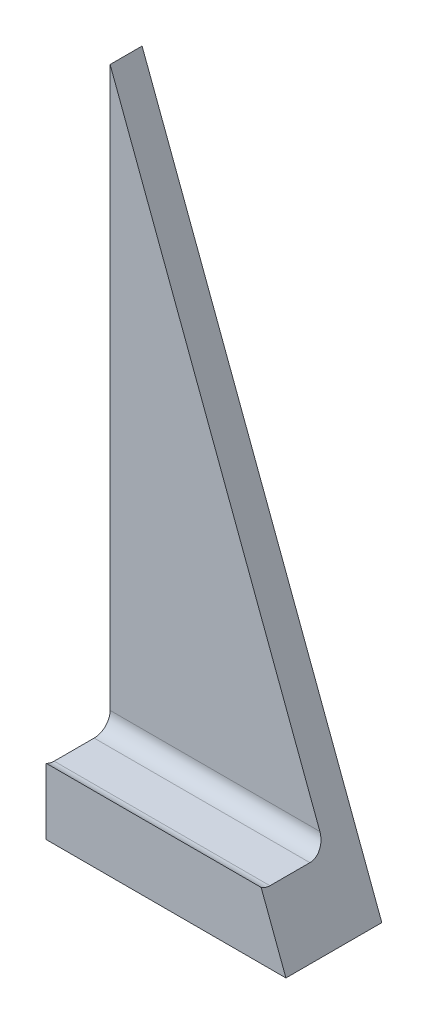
ISO-10303-21;
HEADER;
FILE_DESCRIPTION(('STEP AP214'),'2;1');
FILE_NAME('part.step','',(''),(''),'','','');
FILE_SCHEMA(('AUTOMOTIVE_DESIGN { 1 0 10303 214 1 1 1 1 }'));
ENDSEC;
DATA;
#1=APPLICATION_CONTEXT('core data for automotive mechanical design processes');
#2=APPLICATION_PROTOCOL_DEFINITION('international standard','automotive_design',2000,#1);
#3=PRODUCT_CONTEXT('',#1,'mechanical');
#4=PRODUCT('Part','Part','',(#3));
#5=PRODUCT_RELATED_PRODUCT_CATEGORY('part','',(#4));
#6=PRODUCT_DEFINITION_FORMATION('','',#4);
#7=PRODUCT_DEFINITION_CONTEXT('part definition',#1,'design');
#8=PRODUCT_DEFINITION('design','',#6,#7);
#9=PRODUCT_DEFINITION_SHAPE('','',#8);
#10=(LENGTH_UNIT() NAMED_UNIT(*) SI_UNIT(.MILLI.,.METRE.));
#11=(NAMED_UNIT(*) PLANE_ANGLE_UNIT() SI_UNIT($,.RADIAN.));
#12=(NAMED_UNIT(*) SI_UNIT($,.STERADIAN.) SOLID_ANGLE_UNIT());
#13=UNCERTAINTY_MEASURE_WITH_UNIT(LENGTH_MEASURE(1.E-05),#10,'distance_accuracy_value','');
#14=(GEOMETRIC_REPRESENTATION_CONTEXT(3) GLOBAL_UNCERTAINTY_ASSIGNED_CONTEXT((#13)) GLOBAL_UNIT_ASSIGNED_CONTEXT((#10,
#11,#12)) REPRESENTATION_CONTEXT('',''));
#15=CARTESIAN_POINT('',(0.,0.,0.));
#16=DIRECTION('',(0.,0.,1.));
#17=DIRECTION('',(1.,0.,0.));
#18=AXIS2_PLACEMENT_3D('',#15,#16,#17);
#19=CARTESIAN_POINT('',(-25.,60.,4.));
#20=DIRECTION('',(0.,0.,1.));
#21=DIRECTION('',(1.,0.,0.));
#22=AXIS2_PLACEMENT_3D('',#19,#20,#21);
#23=PLANE('',#22);
#24=DIRECTION('',(0.,-1.,0.));
#25=VECTOR('',#24,1.);
#26=CARTESIAN_POINT('',(0.,70.,4.));
#27=LINE('',#26,#25);
#28=CARTESIAN_POINT('',(0.,80.,4.));
#29=VERTEX_POINT('',#28);
#30=CARTESIAN_POINT('',(0.,10.,4.));
#31=VERTEX_POINT('',#30);
#32=EDGE_CURVE('E96',#29,#31,#27,.T.);
#33=ORIENTED_EDGE('',*,*,#32,.T.);
#34=DIRECTION('',(1.,0.,0.));
#35=VECTOR('',#34,1.);
#36=CARTESIAN_POINT('',(-875.,10.,4.));
#37=LINE('',#36,#35);
#38=CARTESIAN_POINT('',(26.25,10.,4.));
#39=VERTEX_POINT('',#38);
#40=EDGE_CURVE('E10',#31,#39,#37,.T.);
#41=ORIENTED_EDGE('',*,*,#40,.T.);
#42=DIRECTION('',(-0.351123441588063,0.936329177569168,0.));
#43=VECTOR('',#42,1.);
#44=CARTESIAN_POINT('',(16.746575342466,35.342465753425,4.));
#45=LINE('',#44,#43);
#46=EDGE_CURVE('E93',#39,#29,#45,.T.);
#47=ORIENTED_EDGE('',*,*,#46,.T.);
#48=EDGE_LOOP('',(#33,#41,#47));
#49=FACE_BOUND('',#48,.T.);
#50=ADVANCED_FACE('F16',(#49),#23,.T.);
#51=CARTESIAN_POINT('',(-875.,10.,6.));
#52=DIRECTION('',(1.,0.,0.));
#53=DIRECTION('',(0.,0.,1.));
#54=AXIS2_PLACEMENT_3D('',#51,#52,#53);
#55=CYLINDRICAL_SURFACE('',#54,2.);
#56=CARTESIAN_POINT('',(26.25,10.,6.));
#57=DIRECTION('',(-0.936329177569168,-0.351123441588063,0.));
#58=DIRECTION('',(0.351123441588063,-0.936329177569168,0.));
#59=AXIS2_PLACEMENT_3D('',#56,#57,#58);
#60=ELLIPSE('',#59,2.136000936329,2.);
#61=CARTESIAN_POINT('',(27.,8.,6.));
#62=VERTEX_POINT('',#61);
#63=EDGE_CURVE('E102',#39,#62,#60,.T.);
#64=ORIENTED_EDGE('',*,*,#63,.F.);
#65=ORIENTED_EDGE('',*,*,#40,.F.);
#66=CARTESIAN_POINT('',(0.,10.,6.));
#67=DIRECTION('',(1.,0.,0.));
#68=DIRECTION('',(0.,0.,1.));
#69=AXIS2_PLACEMENT_3D('',#66,#67,#68);
#70=CIRCLE('',#69,2.);
#71=CARTESIAN_POINT('',(0.,8.,6.));
#72=VERTEX_POINT('',#71);
#73=EDGE_CURVE('E119',#72,#31,#70,.T.);
#74=ORIENTED_EDGE('',*,*,#73,.F.);
#75=DIRECTION('',(1.,0.,0.));
#76=VECTOR('',#75,1.);
#77=CARTESIAN_POINT('',(-875.,8.,6.));
#78=LINE('',#77,#76);
#79=EDGE_CURVE('E24',#72,#62,#78,.T.);
#80=ORIENTED_EDGE('',*,*,#79,.T.);
#81=EDGE_LOOP('',(#64,#65,#74,#80));
#82=FACE_BOUND('',#81,.T.);
#83=ADVANCED_FACE('F169',(#82),#55,.F.);
#84=CARTESIAN_POINT('',(-875.,8.,6.));
#85=DIRECTION('',(0.,1.,0.));
#86=DIRECTION('',(1.,0.,0.));
#87=AXIS2_PLACEMENT_3D('',#84,#85,#86);
#88=PLANE('',#87);
#89=ORIENTED_EDGE('',*,*,#79,.F.);
#90=DIRECTION('',(0.,0.,1.));
#91=VECTOR('',#90,1.);
#92=CARTESIAN_POINT('',(0.,8.,3.));
#93=LINE('',#92,#91);
#94=CARTESIAN_POINT('',(0.,8.,11.));
#95=VERTEX_POINT('',#94);
#96=EDGE_CURVE('E126',#72,#95,#93,.T.);
#97=ORIENTED_EDGE('',*,*,#96,.T.);
#98=DIRECTION('',(1.,0.,0.));
#99=VECTOR('',#98,1.);
#100=CARTESIAN_POINT('',(-875.,8.,11.));
#101=LINE('',#100,#99);
#102=CARTESIAN_POINT('',(27.,8.,11.));
#103=VERTEX_POINT('',#102);
#104=EDGE_CURVE('E49',#95,#103,#101,.T.);
#105=ORIENTED_EDGE('',*,*,#104,.T.);
#106=DIRECTION('',(0.,0.,-1.));
#107=VECTOR('',#106,1.);
#108=CARTESIAN_POINT('',(27.,8.,3.));
#109=LINE('',#108,#107);
#110=EDGE_CURVE('E155',#103,#62,#109,.T.);
#111=ORIENTED_EDGE('',*,*,#110,.T.);
#112=EDGE_LOOP('',(#89,#97,#105,#111));
#113=FACE_BOUND('',#112,.T.);
#114=ADVANCED_FACE('F171',(#113),#88,.T.);
#115=CARTESIAN_POINT('',(-875.,10.,11.));
#116=DIRECTION('',(1.,0.,0.));
#117=DIRECTION('',(0.,0.,-1.));
#118=AXIS2_PLACEMENT_3D('',#115,#116,#117);
#119=CYLINDRICAL_SURFACE('',#118,2.);
#120=ORIENTED_EDGE('',*,*,#104,.F.);
#121=CARTESIAN_POINT('',(0.,10.,11.));
#122=DIRECTION('',(1.,0.,0.));
#123=DIRECTION('',(0.,0.,-1.));
#124=AXIS2_PLACEMENT_3D('',#121,#122,#123);
#125=CIRCLE('',#124,2.);
#126=CARTESIAN_POINT('',(0.,8.267949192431,12.));
#127=VERTEX_POINT('',#126);
#128=EDGE_CURVE('E145',#127,#95,#125,.T.);
#129=ORIENTED_EDGE('',*,*,#128,.F.);
#130=DIRECTION('',(1.,0.,0.));
#131=VECTOR('',#130,1.);
#132=CARTESIAN_POINT('',(-875.,8.267949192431,12.));
#133=LINE('',#132,#131);
#134=CARTESIAN_POINT('',(26.899519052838,8.267949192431,12.));
#135=VERTEX_POINT('',#134);
#136=EDGE_CURVE('E36',#127,#135,#133,.T.);
#137=ORIENTED_EDGE('',*,*,#136,.T.);
#138=CARTESIAN_POINT('',(26.25,10.,11.));
#139=DIRECTION('',(-0.936329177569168,-0.351123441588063,0.));
#140=DIRECTION('',(0.351123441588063,-0.936329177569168,0.));
#141=AXIS2_PLACEMENT_3D('',#138,#139,#140);
#142=ELLIPSE('',#141,2.136000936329,2.);
#143=EDGE_CURVE('E142',#103,#135,#142,.T.);
#144=ORIENTED_EDGE('',*,*,#143,.F.);
#145=EDGE_LOOP('',(#120,#129,#137,#144));
#146=FACE_BOUND('',#145,.T.);
#147=ADVANCED_FACE('F172',(#146),#119,.F.);
#148=CARTESIAN_POINT('',(8.860009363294,33.860009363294,12.));
#149=DIRECTION('',(0.,0.,1.));
#150=DIRECTION('',(1.,0.,0.));
#151=AXIS2_PLACEMENT_3D('',#148,#149,#150);
#152=PLANE('',#151);
#153=DIRECTION('',(0.,-1.,0.));
#154=VECTOR('',#153,1.);
#155=CARTESIAN_POINT('',(0.,80.,12.));
#156=LINE('',#155,#154);
#157=CARTESIAN_POINT('',(0.,0.,12.));
#158=VERTEX_POINT('',#157);
#159=EDGE_CURVE('E137',#127,#158,#156,.T.);
#160=ORIENTED_EDGE('',*,*,#159,.T.);
#161=DIRECTION('',(1.,0.,0.));
#162=VECTOR('',#161,1.);
#163=CARTESIAN_POINT('',(0.,0.,12.));
#164=LINE('',#163,#162);
#165=CARTESIAN_POINT('',(30.,0.,12.));
#166=VERTEX_POINT('',#165);
#167=EDGE_CURVE('E132',#158,#166,#164,.T.);
#168=ORIENTED_EDGE('',*,*,#167,.T.);
#169=DIRECTION('',(-0.351123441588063,0.936329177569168,0.));
#170=VECTOR('',#169,1.);
#171=CARTESIAN_POINT('',(30.,0.,12.));
#172=LINE('',#171,#170);
#173=EDGE_CURVE('E139',#166,#135,#172,.T.);
#174=ORIENTED_EDGE('',*,*,#173,.T.);
#175=ORIENTED_EDGE('',*,*,#136,.F.);
#176=EDGE_LOOP('',(#160,#168,#174,#175));
#177=FACE_BOUND('',#176,.T.);
#178=ADVANCED_FACE('F177',(#177),#152,.T.);
#179=CARTESIAN_POINT('',(8.860009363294,33.860009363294,0.));
#180=DIRECTION('',(0.,0.,1.));
#181=DIRECTION('',(1.,0.,0.));
#182=AXIS2_PLACEMENT_3D('',#179,#180,#181);
#183=PLANE('',#182);
#184=DIRECTION('',(0.,-1.,0.));
#185=VECTOR('',#184,1.);
#186=CARTESIAN_POINT('',(0.,80.,0.));
#187=LINE('',#186,#185);
#188=CARTESIAN_POINT('',(0.,80.,0.));
#189=VERTEX_POINT('',#188);
#190=CARTESIAN_POINT('',(0.,0.,0.));
#191=VERTEX_POINT('',#190);
#192=EDGE_CURVE('E103',#189,#191,#187,.T.);
#193=ORIENTED_EDGE('',*,*,#192,.F.);
#194=DIRECTION('',(-0.351123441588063,0.936329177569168,0.));
#195=VECTOR('',#194,1.);
#196=CARTESIAN_POINT('',(30.,0.,0.));
#197=LINE('',#196,#195);
#198=CARTESIAN_POINT('',(30.,0.,0.));
#199=VERTEX_POINT('',#198);
#200=EDGE_CURVE('E109',#199,#189,#197,.T.);
#201=ORIENTED_EDGE('',*,*,#200,.F.);
#202=DIRECTION('',(1.,0.,0.));
#203=VECTOR('',#202,1.);
#204=CARTESIAN_POINT('',(0.,0.,0.));
#205=LINE('',#204,#203);
#206=EDGE_CURVE('E183',#191,#199,#205,.T.);
#207=ORIENTED_EDGE('',*,*,#206,.F.);
#208=EDGE_LOOP('',(#193,#201,#207));
#209=FACE_BOUND('',#208,.T.);
#210=ADVANCED_FACE('F190',(#209),#183,.F.);
#211=CARTESIAN_POINT('',(30.,0.,0.));
#212=DIRECTION('',(-0.936329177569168,-0.351123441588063,0.));
#213=DIRECTION('',(-0.351123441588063,0.936329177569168,0.));
#214=AXIS2_PLACEMENT_3D('',#211,#212,#213);
#215=PLANE('',#214);
#216=DIRECTION('',(0.,0.,1.));
#217=VECTOR('',#216,1.);
#218=CARTESIAN_POINT('',(0.,80.,0.));
#219=LINE('',#218,#217);
#220=EDGE_CURVE('E106',#189,#29,#219,.T.);
#221=ORIENTED_EDGE('',*,*,#220,.T.);
#222=ORIENTED_EDGE('',*,*,#46,.F.);
#223=ORIENTED_EDGE('',*,*,#63,.T.);
#224=ORIENTED_EDGE('',*,*,#110,.F.);
#225=ORIENTED_EDGE('',*,*,#143,.T.);
#226=ORIENTED_EDGE('',*,*,#173,.F.);
#227=DIRECTION('',(0.,0.,1.));
#228=VECTOR('',#227,1.);
#229=CARTESIAN_POINT('',(30.,0.,0.));
#230=LINE('',#229,#228);
#231=EDGE_CURVE('E130',#199,#166,#230,.T.);
#232=ORIENTED_EDGE('',*,*,#231,.F.);
#233=ORIENTED_EDGE('',*,*,#200,.T.);
#234=EDGE_LOOP('',(#221,#222,#223,#224,#225,#226,#232,#233));
#235=FACE_BOUND('',#234,.T.);
#236=ADVANCED_FACE('F107',(#235),#215,.F.);
#237=CARTESIAN_POINT('',(0.,80.,0.));
#238=DIRECTION('',(1.,0.,0.));
#239=DIRECTION('',(0.,1.,0.));
#240=AXIS2_PLACEMENT_3D('',#237,#238,#239);
#241=PLANE('',#240);
#242=DIRECTION('',(0.,0.,1.));
#243=VECTOR('',#242,1.);
#244=CARTESIAN_POINT('',(0.,0.,0.));
#245=LINE('',#244,#243);
#246=EDGE_CURVE('E135',#191,#158,#245,.T.);
#247=ORIENTED_EDGE('',*,*,#246,.T.);
#248=ORIENTED_EDGE('',*,*,#159,.F.);
#249=ORIENTED_EDGE('',*,*,#128,.T.);
#250=ORIENTED_EDGE('',*,*,#96,.F.);
#251=ORIENTED_EDGE('',*,*,#73,.T.);
#252=ORIENTED_EDGE('',*,*,#32,.F.);
#253=ORIENTED_EDGE('',*,*,#220,.F.);
#254=ORIENTED_EDGE('',*,*,#192,.T.);
#255=EDGE_LOOP('',(#247,#248,#249,#250,#251,#252,#253,#254));
#256=FACE_BOUND('',#255,.T.);
#257=ADVANCED_FACE('F116',(#256),#241,.F.);
#258=CARTESIAN_POINT('',(0.,0.,0.));
#259=DIRECTION('',(0.,1.,0.));
#260=DIRECTION('',(1.,0.,0.));
#261=AXIS2_PLACEMENT_3D('',#258,#259,#260);
#262=PLANE('',#261);
#263=ORIENTED_EDGE('',*,*,#206,.T.);
#264=ORIENTED_EDGE('',*,*,#231,.T.);
#265=ORIENTED_EDGE('',*,*,#167,.F.);
#266=ORIENTED_EDGE('',*,*,#246,.F.);
#267=EDGE_LOOP('',(#263,#264,#265,#266));
#268=FACE_BOUND('',#267,.T.);
#269=ADVANCED_FACE('F181',(#268),#262,.F.);
#270=CLOSED_SHELL('',(#50,#83,#114,#147,#178,#210,#236,#257,#269));
#271=MANIFOLD_SOLID_BREP('B1',#270);
#272=ADVANCED_BREP_SHAPE_REPRESENTATION('',(#18,#271),#14);
#273=SHAPE_DEFINITION_REPRESENTATION(#9,#272);
ENDSEC;
END-ISO-10303-21;
